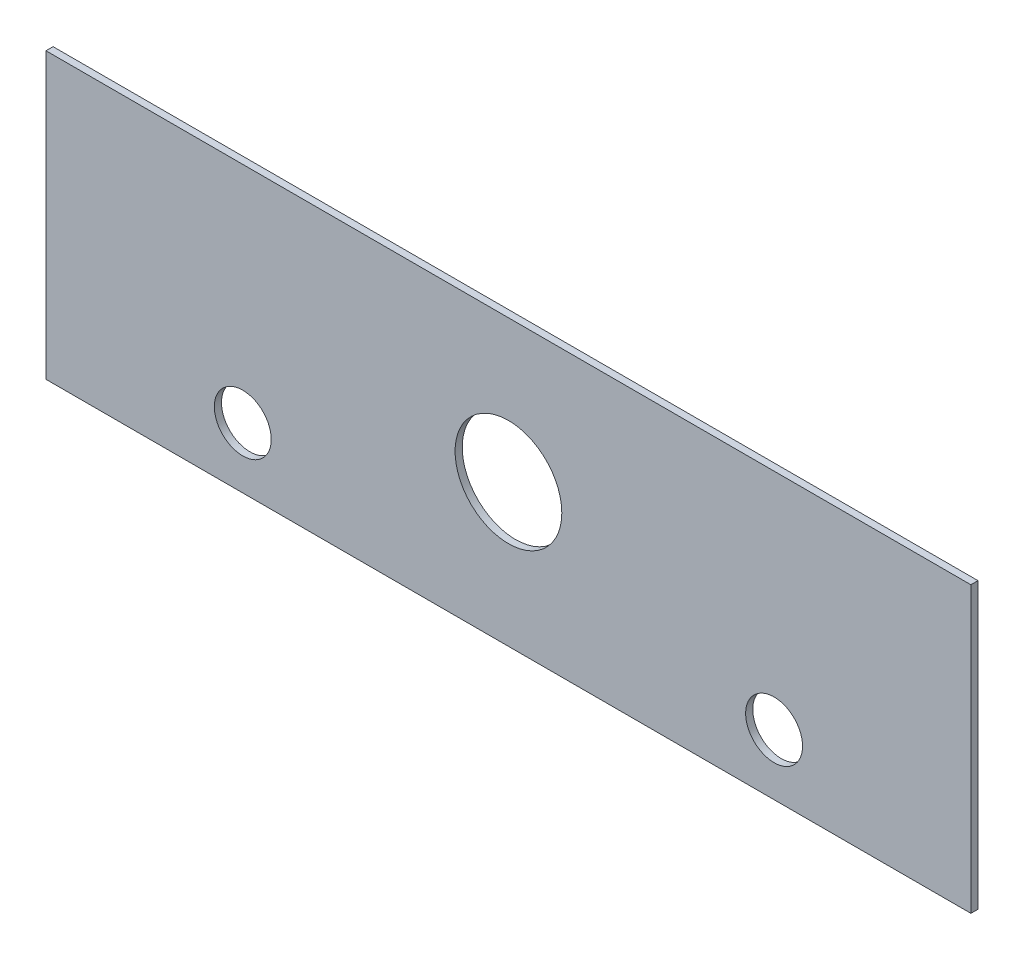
from build123d import *

# Parameters (mm, degrees)
SCHIZZO1_W                   = 130
SCHIZZO1_H                   = 40
SCHIZZO1_R                   = 7.5
SCHIZZO1_R_2                 = 4
ESTRUSIONE_ESTRUSIONE1_DEPTH = 1


with BuildPart() as part:
    # Schizzo1 → Estrusione-Estrusione1 (new body)
    with BuildSketch(Plane.XY):
        Rectangle(SCHIZZO1_W, SCHIZZO1_H)
        Circle(SCHIZZO1_R, mode=Mode.SUBTRACT)
        with Locations((-37.341004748, -11.489539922)):
            Circle(SCHIZZO1_R_2, mode=Mode.SUBTRACT)
        with Locations((37.341004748, -11.489539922)):
            Circle(SCHIZZO1_R_2, mode=Mode.SUBTRACT)
    extrude(amount=ESTRUSIONE_ESTRUSIONE1_DEPTH)


solid = part.part
